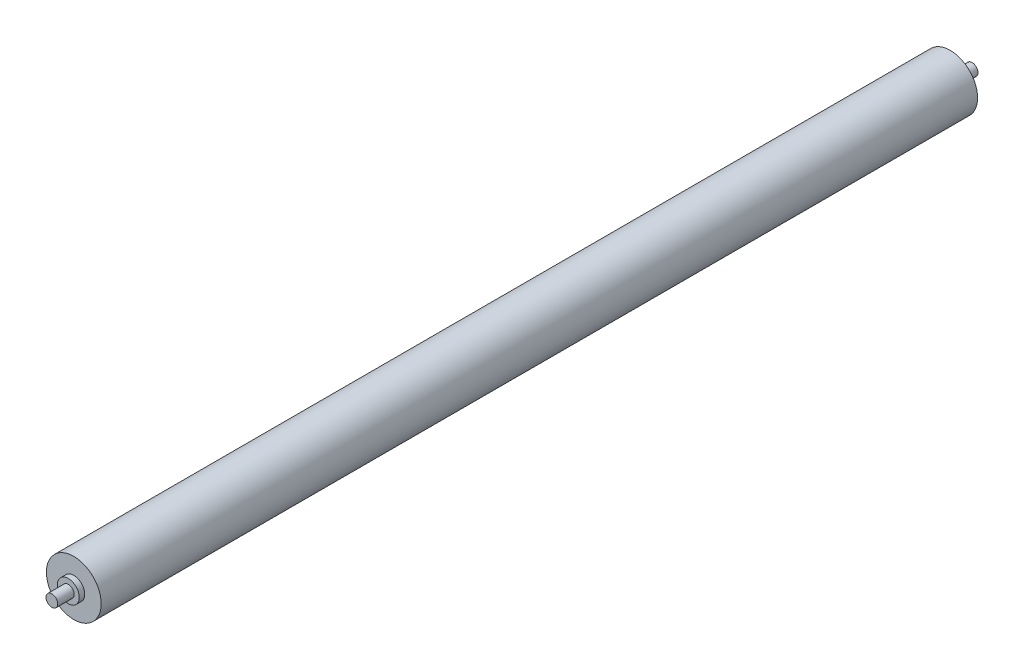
ISO-10303-21;
HEADER;
FILE_DESCRIPTION(('STEP AP214'),'2;1');
FILE_NAME('part.step','',(''),(''),'','','');
FILE_SCHEMA(('AUTOMOTIVE_DESIGN { 1 0 10303 214 1 1 1 1 }'));
ENDSEC;
DATA;
#1=APPLICATION_CONTEXT('core data for automotive mechanical design processes');
#2=APPLICATION_PROTOCOL_DEFINITION('international standard','automotive_design',2000,#1);
#3=PRODUCT_CONTEXT('',#1,'mechanical');
#4=PRODUCT('Part','Part','',(#3));
#5=PRODUCT_RELATED_PRODUCT_CATEGORY('part','',(#4));
#6=PRODUCT_DEFINITION_FORMATION('','',#4);
#7=PRODUCT_DEFINITION_CONTEXT('part definition',#1,'design');
#8=PRODUCT_DEFINITION('design','',#6,#7);
#9=PRODUCT_DEFINITION_SHAPE('','',#8);
#10=(LENGTH_UNIT() NAMED_UNIT(*) SI_UNIT(.MILLI.,.METRE.));
#11=(NAMED_UNIT(*) PLANE_ANGLE_UNIT() SI_UNIT($,.RADIAN.));
#12=(NAMED_UNIT(*) SI_UNIT($,.STERADIAN.) SOLID_ANGLE_UNIT());
#13=UNCERTAINTY_MEASURE_WITH_UNIT(LENGTH_MEASURE(1.E-05),#10,'distance_accuracy_value','');
#14=(GEOMETRIC_REPRESENTATION_CONTEXT(3) GLOBAL_UNCERTAINTY_ASSIGNED_CONTEXT((#13)) GLOBAL_UNIT_ASSIGNED_CONTEXT((#10,
#11,#12)) REPRESENTATION_CONTEXT('',''));
#15=CARTESIAN_POINT('',(0.,0.,0.));
#16=DIRECTION('',(0.,0.,1.));
#17=DIRECTION('',(1.,0.,0.));
#18=AXIS2_PLACEMENT_3D('',#15,#16,#17);
#19=CARTESIAN_POINT('',(0.,0.,825.));
#20=DIRECTION('',(0.,0.,1.));
#21=DIRECTION('',(1.,0.,0.));
#22=AXIS2_PLACEMENT_3D('',#19,#20,#21);
#23=PLANE('',#22);
#24=CARTESIAN_POINT('',(0.,0.,825.));
#25=DIRECTION('',(0.,0.,1.));
#26=DIRECTION('',(1.,0.,0.));
#27=AXIS2_PLACEMENT_3D('',#24,#25,#26);
#28=CIRCLE('',#27,10.);
#29=CARTESIAN_POINT('',(10.,0.,825.));
#30=VERTEX_POINT('',#29);
#31=EDGE_CURVE('E61',#30,#30,#28,.T.);
#32=ORIENTED_EDGE('',*,*,#31,.T.);
#33=EDGE_LOOP('',(#32));
#34=FACE_BOUND('',#33,.T.);
#35=CARTESIAN_POINT('',(0.,0.,825.));
#36=DIRECTION('',(0.,0.,1.));
#37=DIRECTION('',(1.,0.,0.));
#38=AXIS2_PLACEMENT_3D('',#35,#36,#37);
#39=CIRCLE('',#38,5.37307692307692);
#40=CARTESIAN_POINT('',(5.37307692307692,0.,825.));
#41=VERTEX_POINT('',#40);
#42=EDGE_CURVE('E70',#41,#41,#39,.T.);
#43=ORIENTED_EDGE('',*,*,#42,.F.);
#44=EDGE_LOOP('',(#43));
#45=FACE_BOUND('',#44,.T.);
#46=ADVANCED_FACE('F34',(#34,#45),#23,.T.);
#47=CARTESIAN_POINT('',(0.,0.,820.));
#48=DIRECTION('',(0.,0.,1.));
#49=DIRECTION('',(1.,0.,0.));
#50=AXIS2_PLACEMENT_3D('',#47,#48,#49);
#51=PLANE('',#50);
#52=CARTESIAN_POINT('',(0.,0.,820.));
#53=DIRECTION('',(0.,0.,1.));
#54=DIRECTION('',(1.,0.,0.));
#55=AXIS2_PLACEMENT_3D('',#52,#53,#54);
#56=CIRCLE('',#55,25.);
#57=CARTESIAN_POINT('',(25.,0.,820.));
#58=VERTEX_POINT('',#57);
#59=EDGE_CURVE('E54',#58,#58,#56,.T.);
#60=ORIENTED_EDGE('',*,*,#59,.T.);
#61=EDGE_LOOP('',(#60));
#62=FACE_BOUND('',#61,.T.);
#63=CARTESIAN_POINT('',(0.,0.,820.));
#64=DIRECTION('',(0.,0.,1.));
#65=DIRECTION('',(1.,0.,0.));
#66=AXIS2_PLACEMENT_3D('',#63,#64,#65);
#67=CIRCLE('',#66,10.);
#68=CARTESIAN_POINT('',(10.,0.,820.));
#69=VERTEX_POINT('',#68);
#70=EDGE_CURVE('E64',#69,#69,#67,.T.);
#71=ORIENTED_EDGE('',*,*,#70,.F.);
#72=EDGE_LOOP('',(#71));
#73=FACE_BOUND('',#72,.T.);
#74=ADVANCED_FACE('F86',(#62,#73),#51,.T.);
#75=CARTESIAN_POINT('',(0.,0.,15.));
#76=DIRECTION('',(0.,0.,-1.));
#77=DIRECTION('',(-1.,0.,0.));
#78=AXIS2_PLACEMENT_3D('',#75,#76,#77);
#79=CYLINDRICAL_SURFACE('',#78,5.37307692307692);
#80=CARTESIAN_POINT('',(0.,0.,15.));
#81=DIRECTION('',(0.,0.,1.));
#82=DIRECTION('',(1.,0.,0.));
#83=AXIS2_PLACEMENT_3D('',#80,#81,#82);
#84=CIRCLE('',#83,5.37307692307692);
#85=CARTESIAN_POINT('',(5.37307692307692,0.,15.));
#86=VERTEX_POINT('',#85);
#87=EDGE_CURVE('E10',#86,#86,#84,.T.);
#88=ORIENTED_EDGE('',*,*,#87,.F.);
#89=EDGE_LOOP('',(#88));
#90=FACE_BOUND('',#89,.T.);
#91=CARTESIAN_POINT('',(0.,0.,0.));
#92=DIRECTION('',(0.,0.,1.));
#93=DIRECTION('',(1.,0.,0.));
#94=AXIS2_PLACEMENT_3D('',#91,#92,#93);
#95=CIRCLE('',#94,5.37307692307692);
#96=CARTESIAN_POINT('',(5.37307692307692,0.,0.));
#97=VERTEX_POINT('',#96);
#98=EDGE_CURVE('E38',#97,#97,#95,.T.);
#99=ORIENTED_EDGE('',*,*,#98,.T.);
#100=EDGE_LOOP('',(#99));
#101=FACE_BOUND('',#100,.T.);
#102=ADVANCED_FACE('F36',(#90,#101),#79,.T.);
#103=CARTESIAN_POINT('',(0.,0.,0.));
#104=DIRECTION('',(0.,0.,1.));
#105=DIRECTION('',(1.,0.,0.));
#106=AXIS2_PLACEMENT_3D('',#103,#104,#105);
#107=PLANE('',#106);
#108=ORIENTED_EDGE('',*,*,#98,.F.);
#109=EDGE_LOOP('',(#108));
#110=FACE_BOUND('',#109,.T.);
#111=ADVANCED_FACE('F111',(#110),#107,.F.);
#112=CARTESIAN_POINT('',(0.,0.,15.));
#113=DIRECTION('',(0.,0.,1.));
#114=DIRECTION('',(1.,0.,0.));
#115=AXIS2_PLACEMENT_3D('',#112,#113,#114);
#116=PLANE('',#115);
#117=CARTESIAN_POINT('',(0.,0.,15.));
#118=DIRECTION('',(0.,0.,1.));
#119=DIRECTION('',(1.,0.,0.));
#120=AXIS2_PLACEMENT_3D('',#117,#118,#119);
#121=CIRCLE('',#120,10.);
#122=CARTESIAN_POINT('',(10.,0.,15.));
#123=VERTEX_POINT('',#122);
#124=EDGE_CURVE('E50',#123,#123,#121,.T.);
#125=ORIENTED_EDGE('',*,*,#124,.F.);
#126=EDGE_LOOP('',(#125));
#127=FACE_BOUND('',#126,.T.);
#128=ORIENTED_EDGE('',*,*,#87,.T.);
#129=EDGE_LOOP('',(#128));
#130=FACE_BOUND('',#129,.T.);
#131=ADVANCED_FACE('F108',(#127,#130),#116,.F.);
#132=CARTESIAN_POINT('',(0.,0.,20.));
#133=DIRECTION('',(0.,0.,-1.));
#134=DIRECTION('',(-1.,0.,0.));
#135=AXIS2_PLACEMENT_3D('',#132,#133,#134);
#136=CYLINDRICAL_SURFACE('',#135,10.);
#137=CARTESIAN_POINT('',(0.,0.,20.));
#138=DIRECTION('',(0.,0.,1.));
#139=DIRECTION('',(1.,0.,0.));
#140=AXIS2_PLACEMENT_3D('',#137,#138,#139);
#141=CIRCLE('',#140,10.);
#142=CARTESIAN_POINT('',(10.,0.,20.));
#143=VERTEX_POINT('',#142);
#144=EDGE_CURVE('E48',#143,#143,#141,.T.);
#145=ORIENTED_EDGE('',*,*,#144,.F.);
#146=EDGE_LOOP('',(#145));
#147=FACE_BOUND('',#146,.T.);
#148=ORIENTED_EDGE('',*,*,#124,.T.);
#149=EDGE_LOOP('',(#148));
#150=FACE_BOUND('',#149,.T.);
#151=ADVANCED_FACE('F103',(#147,#150),#136,.T.);
#152=CARTESIAN_POINT('',(0.,0.,20.));
#153=DIRECTION('',(0.,0.,1.));
#154=DIRECTION('',(1.,0.,0.));
#155=AXIS2_PLACEMENT_3D('',#152,#153,#154);
#156=PLANE('',#155);
#157=CARTESIAN_POINT('',(0.,0.,20.));
#158=DIRECTION('',(0.,0.,1.));
#159=DIRECTION('',(1.,0.,0.));
#160=AXIS2_PLACEMENT_3D('',#157,#158,#159);
#161=CIRCLE('',#160,25.);
#162=CARTESIAN_POINT('',(25.,0.,20.));
#163=VERTEX_POINT('',#162);
#164=EDGE_CURVE('E57',#163,#163,#161,.T.);
#165=ORIENTED_EDGE('',*,*,#164,.F.);
#166=EDGE_LOOP('',(#165));
#167=FACE_BOUND('',#166,.T.);
#168=ORIENTED_EDGE('',*,*,#144,.T.);
#169=EDGE_LOOP('',(#168));
#170=FACE_BOUND('',#169,.T.);
#171=ADVANCED_FACE('F100',(#167,#170),#156,.F.);
#172=CARTESIAN_POINT('',(0.,0.,820.));
#173=DIRECTION('',(0.,0.,-1.));
#174=DIRECTION('',(-1.,0.,0.));
#175=AXIS2_PLACEMENT_3D('',#172,#173,#174);
#176=CYLINDRICAL_SURFACE('',#175,25.);
#177=ORIENTED_EDGE('',*,*,#59,.F.);
#178=EDGE_LOOP('',(#177));
#179=FACE_BOUND('',#178,.T.);
#180=ORIENTED_EDGE('',*,*,#164,.T.);
#181=EDGE_LOOP('',(#180));
#182=FACE_BOUND('',#181,.T.);
#183=ADVANCED_FACE('F97',(#179,#182),#176,.T.);
#184=CARTESIAN_POINT('',(0.,0.,825.));
#185=DIRECTION('',(0.,0.,-1.));
#186=DIRECTION('',(-1.,0.,0.));
#187=AXIS2_PLACEMENT_3D('',#184,#185,#186);
#188=CYLINDRICAL_SURFACE('',#187,10.);
#189=ORIENTED_EDGE('',*,*,#31,.F.);
#190=EDGE_LOOP('',(#189));
#191=FACE_BOUND('',#190,.T.);
#192=ORIENTED_EDGE('',*,*,#70,.T.);
#193=EDGE_LOOP('',(#192));
#194=FACE_BOUND('',#193,.T.);
#195=ADVANCED_FACE('F81',(#191,#194),#188,.T.);
#196=CARTESIAN_POINT('',(0.,0.,840.));
#197=DIRECTION('',(0.,0.,-1.));
#198=DIRECTION('',(-1.,0.,0.));
#199=AXIS2_PLACEMENT_3D('',#196,#197,#198);
#200=CYLINDRICAL_SURFACE('',#199,5.37307692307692);
#201=CARTESIAN_POINT('',(0.,0.,840.));
#202=DIRECTION('',(0.,0.,1.));
#203=DIRECTION('',(1.,0.,0.));
#204=AXIS2_PLACEMENT_3D('',#201,#202,#203);
#205=CIRCLE('',#204,5.37307692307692);
#206=CARTESIAN_POINT('',(5.37307692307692,0.,840.));
#207=VERTEX_POINT('',#206);
#208=EDGE_CURVE('E67',#207,#207,#205,.T.);
#209=ORIENTED_EDGE('',*,*,#208,.F.);
#210=EDGE_LOOP('',(#209));
#211=FACE_BOUND('',#210,.T.);
#212=ORIENTED_EDGE('',*,*,#42,.T.);
#213=EDGE_LOOP('',(#212));
#214=FACE_BOUND('',#213,.T.);
#215=ADVANCED_FACE('F78',(#211,#214),#200,.T.);
#216=CARTESIAN_POINT('',(0.,0.,840.));
#217=DIRECTION('',(0.,0.,1.));
#218=DIRECTION('',(1.,0.,0.));
#219=AXIS2_PLACEMENT_3D('',#216,#217,#218);
#220=PLANE('',#219);
#221=ORIENTED_EDGE('',*,*,#208,.T.);
#222=EDGE_LOOP('',(#221));
#223=FACE_BOUND('',#222,.T.);
#224=ADVANCED_FACE('F76',(#223),#220,.T.);
#225=CLOSED_SHELL('',(#46,#74,#102,#111,#131,#151,#171,#183,#195,#215,#224));
#226=MANIFOLD_SOLID_BREP('B2',#225);
#227=ADVANCED_BREP_SHAPE_REPRESENTATION('',(#18,#226),#14);
#228=SHAPE_DEFINITION_REPRESENTATION(#9,#227);
ENDSEC;
END-ISO-10303-21;
